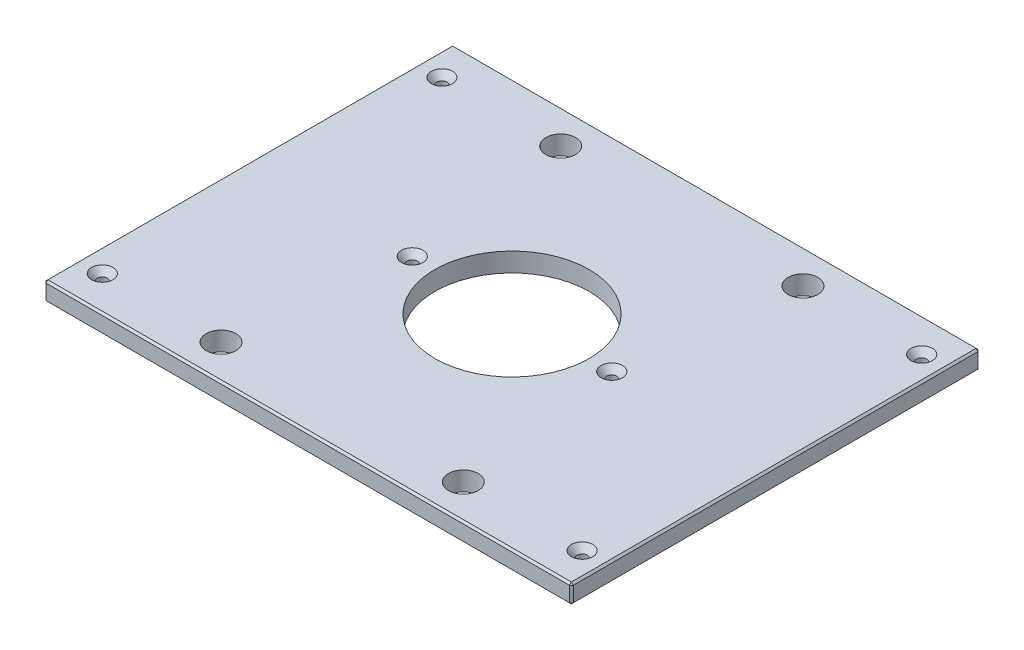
from build123d import *

# Parameters (mm, degrees)
SKETCH1_W                                        = 352.425
SKETCH1_H                                        = 273.05
BOSS_EXTRUDE1_DEPTH                              = 12.7
SKETCH13_R                                       = 51.562
CUT_EXTRUDE6_DEPTH                               = 224.273847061
F_25_32_0_78125_DIAMETER_HOLE1_D                 = 19.84375
CHAMFER2_SIZE                                    = 1.27
CSK_FOR_1_4_FLAT_HEAD_MACHINE_SCREW1_D           = 6.7564
CSK_FOR_1_4_FLAT_HEAD_MACHINE_SCREW1_CSINK_D     = 14.2748
CSK_FOR_1_4_FLAT_HEAD_MACHINE_SCREW1_CSINK_ANGLE = 82


with BuildPart() as part:
    # Sketch1 → Boss-Extrude1 (new body)
    with BuildSketch(Plane(origin=(0, 0, 0), x_dir=(1, 0, 0), z_dir=(0, 1, 0))):
        Rectangle(SKETCH1_W, SKETCH1_H)
    extrude(amount=BOSS_EXTRUDE1_DEPTH)

    # Sketch13 → Cut-Extrude6 (cut, through all)
    with BuildSketch(Plane(origin=(0, 12.7, 0), x_dir=(1, 0, 0), z_dir=(0, 1, 0))):
        with Locations(Location((0, 0, 0), (0, 0, 270))):
            Circle(SKETCH13_R)
    extrude(amount=-CUT_EXTRUDE6_DEPTH, mode=Mode.SUBTRACT)

    # 25_32 _0.78125_ Diameter Hole1 (through all)
    with Locations(Plane(origin=(0, 12.7, 0), x_dir=(1, 0, 0), z_dir=(0, 1, 0))):
        with Locations((80.9625, 113.50498), (-80.9625, 113.50498), (80.9625, -113.50498), (-80.9625, -113.50498)):
            Hole(F_25_32_0_78125_DIAMETER_HOLE1_D / 2)

    # Chamfer2
    chamfer2_edges = [part.edges().sort_by_distance(p)[0] for p in [
        (176.2125, 12.7, 0),
        (0, 12.7, -136.525),
        (-176.2125, 12.7, 0),
        (0, 0, -136.525),
        (176.2125, 0, 0),
        (0, 0, 136.525),
        (-176.2125, 0, 0),
        (0, 12.7, 136.525),
        (-176.2125, 6.35, -136.525),
        (176.2125, 6.35, -136.525),
        (176.2125, 6.35, 136.525),
        (-176.2125, 6.35, 136.525),
    ]]
    chamfer(chamfer2_edges, length=CHAMFER2_SIZE)

    # CSK for 1_4 Flat Head Machine Screw1 (through all)
    with Locations(Plane(origin=(0, 12.7, 0), x_dir=(1, 0, 0), z_dir=(0, 1, 0))):
        with Locations((160.3375, 113.50498), (160.3375, -113.50498), (-160.3375, -113.50498), (-66.675, 0), (66.675, 0), (-160.3375, 113.50498), (-80.9625, 113.50498), (-80.9625, -113.50498)):
            CounterSinkHole(CSK_FOR_1_4_FLAT_HEAD_MACHINE_SCREW1_D / 2, CSK_FOR_1_4_FLAT_HEAD_MACHINE_SCREW1_CSINK_D / 2, counter_sink_angle=CSK_FOR_1_4_FLAT_HEAD_MACHINE_SCREW1_CSINK_ANGLE)


solid = part.part
